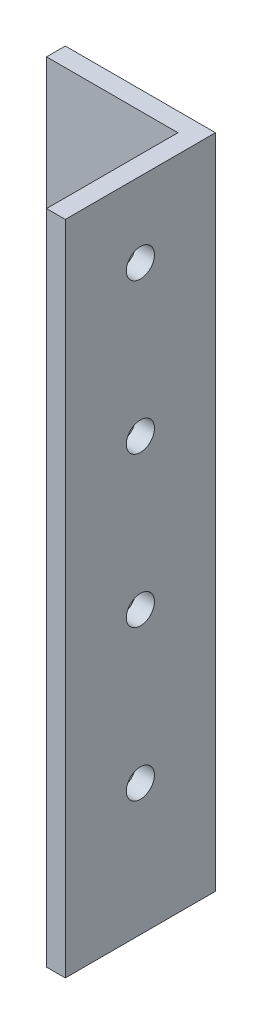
from build123d import *

# Parameters (mm, degrees)
BOSS_EXTRUDE1_DEPTH = 111.10976
SKETCH4_R           = 2.38125
CUT_EXTRUDE2_DEPTH  = 115.681422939
LPATTERN2_COUNT     = 4
LPATTERN2_PITCH     = 25.4


with BuildPart() as part:
    # Sketch2 → Boss-Extrude1 (new body)
    with BuildSketch(Plane(origin=(0, 0, 0), x_dir=(1, 0, 0), z_dir=(0, 1, 0))):
        Polygon((-9.525, 9.525), (9.525, 9.525), (9.525, -9.525), (9.525, -12.7), (12.7, -12.7), (12.7, 12.7), (-12.7, 12.7), (-12.7, 9.525), align=None)
    extrude(amount=BOSS_EXTRUDE1_DEPTH)

    # Sketch4 → Cut-Extrude2 (cut, through all)
    with BuildSketch(Plane(origin=(12.7, 0, 0), x_dir=(0, 0, -1), z_dir=(1, 0, 0))):
        with Locations((0, 98.40976)):
            Circle(SKETCH4_R)
    cut_extrude2 = extrude(amount=-CUT_EXTRUDE2_DEPTH, mode=Mode.SUBTRACT)

    # LPattern2: Cut-Extrude2 ×4
    with Locations(*[(0, -i * LPATTERN2_PITCH, 0) for i in range(1, LPATTERN2_COUNT)]):
        add(cut_extrude2, mode=Mode.SUBTRACT)


solid = part.part
